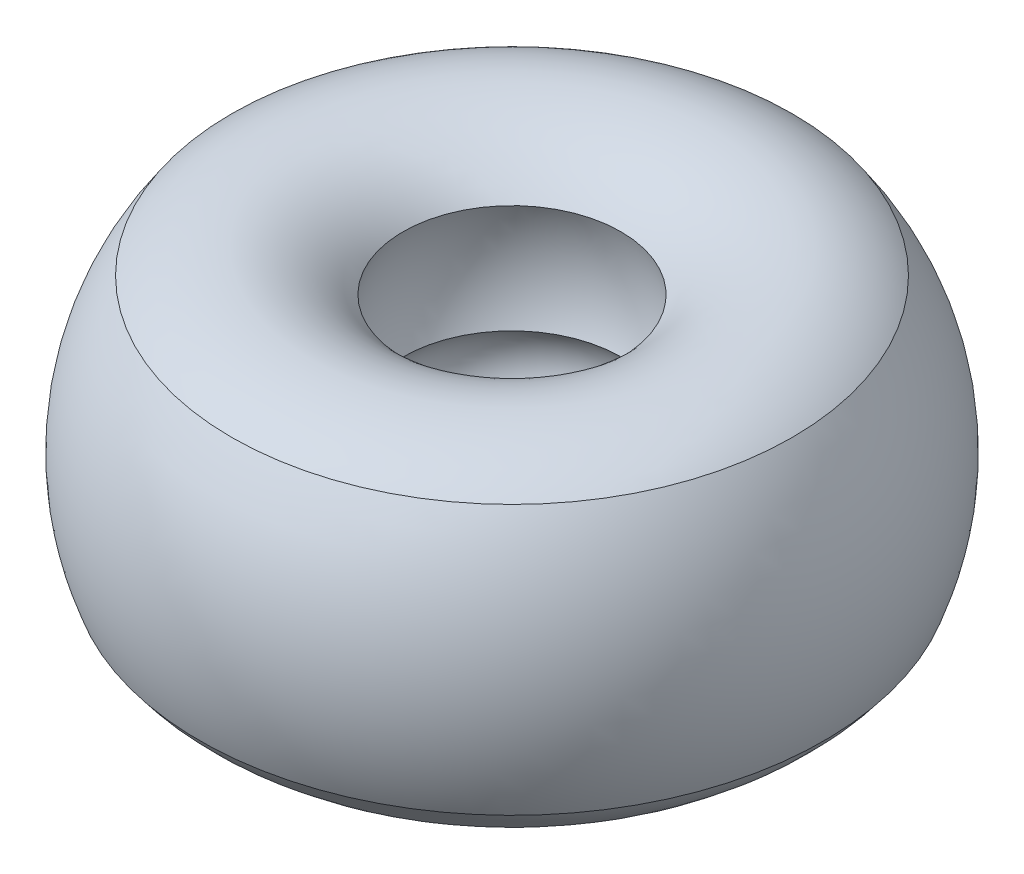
ISO-10303-21;
HEADER;
FILE_DESCRIPTION(('STEP AP214'),'2;1');
FILE_NAME('part.step','',(''),(''),'','','');
FILE_SCHEMA(('AUTOMOTIVE_DESIGN { 1 0 10303 214 1 1 1 1 }'));
ENDSEC;
DATA;
#1=APPLICATION_CONTEXT('core data for automotive mechanical design processes');
#2=APPLICATION_PROTOCOL_DEFINITION('international standard','automotive_design',2000,#1);
#3=PRODUCT_CONTEXT('',#1,'mechanical');
#4=PRODUCT('Part','Part','',(#3));
#5=PRODUCT_RELATED_PRODUCT_CATEGORY('part','',(#4));
#6=PRODUCT_DEFINITION_FORMATION('','',#4);
#7=PRODUCT_DEFINITION_CONTEXT('part definition',#1,'design');
#8=PRODUCT_DEFINITION('design','',#6,#7);
#9=PRODUCT_DEFINITION_SHAPE('','',#8);
#10=(LENGTH_UNIT() NAMED_UNIT(*) SI_UNIT(.MILLI.,.METRE.));
#11=(NAMED_UNIT(*) PLANE_ANGLE_UNIT() SI_UNIT($,.RADIAN.));
#12=(NAMED_UNIT(*) SI_UNIT($,.STERADIAN.) SOLID_ANGLE_UNIT());
#13=UNCERTAINTY_MEASURE_WITH_UNIT(LENGTH_MEASURE(1.E-05),#10,'distance_accuracy_value','');
#14=(GEOMETRIC_REPRESENTATION_CONTEXT(3) GLOBAL_UNCERTAINTY_ASSIGNED_CONTEXT((#13)) GLOBAL_UNIT_ASSIGNED_CONTEXT((#10,
#11,#12)) REPRESENTATION_CONTEXT('',''));
#15=CARTESIAN_POINT('',(0.,0.,0.));
#16=DIRECTION('',(0.,0.,1.));
#17=DIRECTION('',(1.,0.,0.));
#18=AXIS2_PLACEMENT_3D('',#15,#16,#17);
#19=CARTESIAN_POINT('',(0.,499.999999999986,0.));
#20=DIRECTION('',(0.,-1.,0.));
#21=DIRECTION('',(0.,0.,-1.));
#22=AXIS2_PLACEMENT_3D('',#19,#20,#21);
#23=TOROIDAL_SURFACE('',#22,650.000000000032,456.451128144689);
#24=CARTESIAN_POINT('',(0.,761.404392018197,0.));
#25=DIRECTION('',(0.,-1.,0.));
#26=DIRECTION('',(0.,0.,-1.));
#27=AXIS2_PLACEMENT_3D('',#24,#25,#26);
#28=CIRCLE('',#27,1024.18628544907);
#29=CARTESIAN_POINT('',(0.,761.404392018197,-1024.18628544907));
#30=VERTEX_POINT('',#29);
#31=EDGE_CURVE('E36',#30,#30,#28,.T.);
#32=ORIENTED_EDGE('',*,*,#31,.F.);
#33=EDGE_LOOP('',(#32));
#34=FACE_BOUND('',#33,.T.);
#35=CARTESIAN_POINT('',(0.,100.539346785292,0.));
#36=DIRECTION('',(0.,-1.,0.));
#37=DIRECTION('',(0.,0.,-1.));
#38=AXIS2_PLACEMENT_3D('',#35,#36,#37);
#39=CIRCLE('',#38,870.859274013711);
#40=CARTESIAN_POINT('',(0.,100.539346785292,-870.859274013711));
#41=VERTEX_POINT('',#40);
#42=EDGE_CURVE('E9',#41,#41,#39,.T.);
#43=ORIENTED_EDGE('',*,*,#42,.T.);
#44=EDGE_LOOP('',(#43));
#45=FACE_BOUND('',#44,.T.);
#46=ADVANCED_FACE('F14',(#34,#45),#23,.F.);
#47=CARTESIAN_POINT('',(0.,-700.808726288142,0.));
#48=DIRECTION('',(0.,-1.,0.));
#49=DIRECTION('',(0.,0.,-1.));
#50=AXIS2_PLACEMENT_3D('',#47,#48,#49);
#51=DEGENERATE_TOROIDAL_SURFACE('',#50,11.5186746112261,1174.99999999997,.T.);
#52=ORIENTED_EDGE('',*,*,#42,.F.);
#53=EDGE_LOOP('',(#52));
#54=FACE_BOUND('',#53,.T.);
#55=CARTESIAN_POINT('',(0.,-803.216724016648,0.));
#56=DIRECTION('',(0.,-1.,0.));
#57=DIRECTION('',(0.,0.,-1.));
#58=AXIS2_PLACEMENT_3D('',#55,#56,#57);
#59=CIRCLE('',#58,1182.047444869);
#60=CARTESIAN_POINT('',(0.,-803.216724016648,-1182.047444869));
#61=VERTEX_POINT('',#60);
#62=EDGE_CURVE('E20',#61,#61,#59,.T.);
#63=ORIENTED_EDGE('',*,*,#62,.T.);
#64=EDGE_LOOP('',(#63));
#65=FACE_BOUND('',#64,.T.);
#66=ADVANCED_FACE('F43',(#54,#65),#51,.F.);
#67=CARTESIAN_POINT('',(0.,397.592002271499,0.));
#68=DIRECTION('',(0.,-1.,0.));
#69=DIRECTION('',(0.,0.,-1.));
#70=AXIS2_PLACEMENT_3D('',#67,#68,#69);
#71=TOROIDAL_SURFACE('',#70,1820.5287702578,1360.);
#72=ORIENTED_EDGE('',*,*,#62,.F.);
#73=EDGE_LOOP('',(#72));
#74=FACE_BOUND('',#73,.T.);
#75=CARTESIAN_POINT('',(0.,-382.471951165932,0.));
#76=DIRECTION('',(0.,-1.,0.));
#77=DIRECTION('',(0.,0.,-1.));
#78=AXIS2_PLACEMENT_3D('',#75,#76,#77);
#79=CIRCLE('',#78,2934.57555049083);
#80=CARTESIAN_POINT('',(0.,-382.471951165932,-2934.57555049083));
#81=VERTEX_POINT('',#80);
#82=EDGE_CURVE('E24',#81,#81,#79,.T.);
#83=ORIENTED_EDGE('',*,*,#82,.T.);
#84=EDGE_LOOP('',(#83));
#85=FACE_BOUND('',#84,.T.);
#86=ADVANCED_FACE('F49',(#74,#85),#71,.T.);
#87=CARTESIAN_POINT('',(0.,500.,0.));
#88=DIRECTION('',(0.,-1.,0.));
#89=DIRECTION('',(0.,0.,-1.));
#90=AXIS2_PLACEMENT_3D('',#87,#88,#89);
#91=DEGENERATE_TOROIDAL_SURFACE('',#90,650.,2449.09007398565,.T.);
#92=ORIENTED_EDGE('',*,*,#82,.F.);
#93=EDGE_LOOP('',(#92));
#94=FACE_BOUND('',#93,.T.);
#95=CARTESIAN_POINT('',(0.,1935.37760253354,0.));
#96=DIRECTION('',(0.,-1.,0.));
#97=DIRECTION('',(0.,0.,-1.));
#98=AXIS2_PLACEMENT_3D('',#95,#96,#97);
#99=CIRCLE('',#98,2634.37227571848);
#100=CARTESIAN_POINT('',(0.,1935.37760253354,-2634.37227571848));
#101=VERTEX_POINT('',#100);
#102=EDGE_CURVE('E28',#101,#101,#99,.T.);
#103=ORIENTED_EDGE('',*,*,#102,.T.);
#104=EDGE_LOOP('',(#103));
#105=FACE_BOUND('',#104,.T.);
#106=ADVANCED_FACE('F55',(#94,#105),#91,.T.);
#107=CARTESIAN_POINT('',(0.,1009.46496704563,0.));
#108=DIRECTION('',(0.,-1.,0.));
#109=DIRECTION('',(0.,0.,-1.));
#110=AXIS2_PLACEMENT_3D('',#107,#108,#109);
#111=TOROIDAL_SURFACE('',#110,1910.97004221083,1175.);
#112=ORIENTED_EDGE('',*,*,#102,.F.);
#113=EDGE_LOOP('',(#112));
#114=FACE_BOUND('',#113,.T.);
#115=CARTESIAN_POINT('',(0.,1780.33432610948,0.));
#116=DIRECTION('',(0.,-1.,0.));
#117=DIRECTION('',(0.,0.,-1.));
#118=AXIS2_PLACEMENT_3D('',#115,#116,#117);
#119=CIRCLE('',#118,1024.18628544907);
#120=CARTESIAN_POINT('',(0.,1780.33432610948,-1024.18628544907));
#121=VERTEX_POINT('',#120);
#122=EDGE_CURVE('E33',#121,#121,#119,.T.);
#123=ORIENTED_EDGE('',*,*,#122,.T.);
#124=EDGE_LOOP('',(#123));
#125=FACE_BOUND('',#124,.T.);
#126=ADVANCED_FACE('F61',(#114,#125),#111,.T.);
#127=CARTESIAN_POINT('',(0.,1270.86935906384,0.));
#128=DIRECTION('',(0.,-1.,0.));
#129=DIRECTION('',(0.,0.,-1.));
#130=AXIS2_PLACEMENT_3D('',#127,#128,#129);
#131=DEGENERATE_TOROIDAL_SURFACE('',#130,236.783756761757,1360.,.F.);
#132=ORIENTED_EDGE('',*,*,#122,.F.);
#133=EDGE_LOOP('',(#132));
#134=FACE_BOUND('',#133,.T.);
#135=ORIENTED_EDGE('',*,*,#31,.T.);
#136=EDGE_LOOP('',(#135));
#137=FACE_BOUND('',#136,.T.);
#138=ADVANCED_FACE('F40',(#134,#137),#131,.T.);
#139=CLOSED_SHELL('',(#46,#66,#86,#106,#126,#138));
#140=MANIFOLD_SOLID_BREP('B1',#139);
#141=ADVANCED_BREP_SHAPE_REPRESENTATION('',(#18,#140),#14);
#142=SHAPE_DEFINITION_REPRESENTATION(#9,#141);
ENDSEC;
END-ISO-10303-21;
